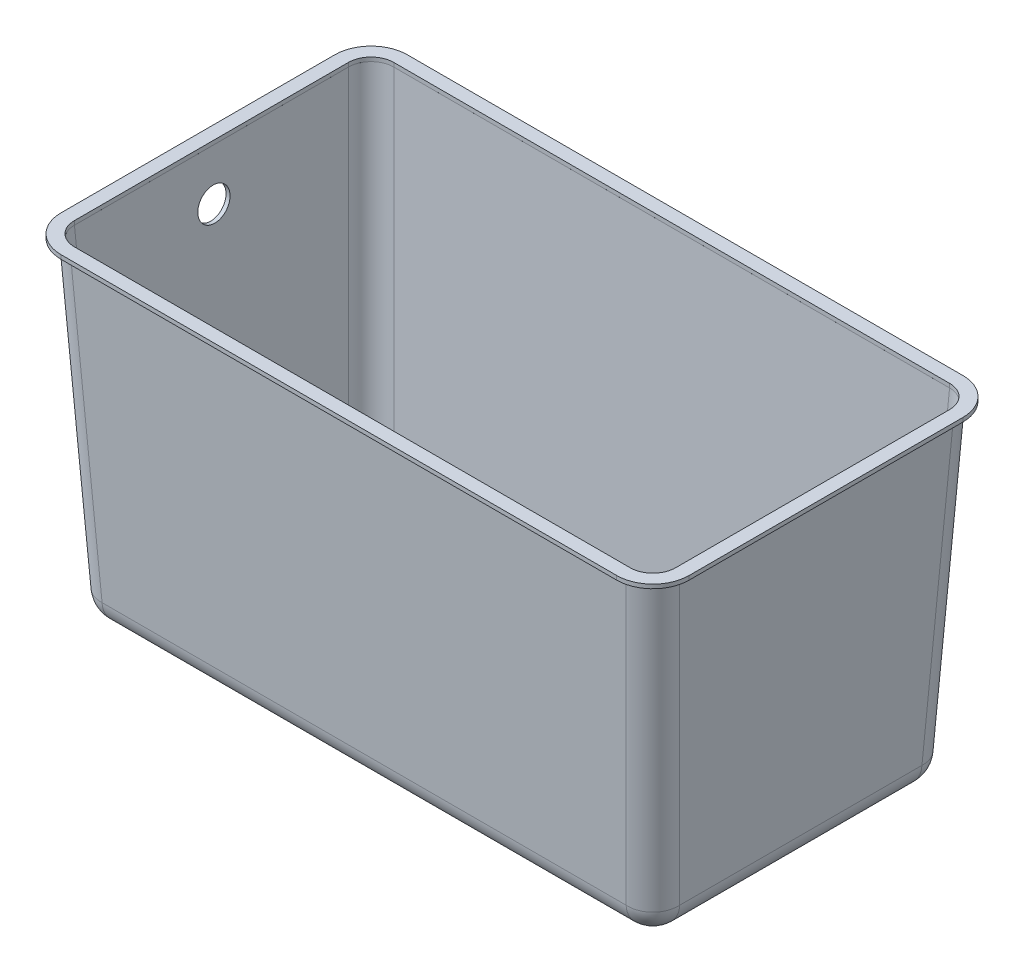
from build123d import *

# Parameters (mm, degrees)
ESQUISSE1_W             = 454
ESQUISSE1_H             = 244
EXTRUSION1_DEPTH        = 244
EXTRUSION1_DRAFT        = -3
CONG_1_R                = 20
COQUE1_T                = -3
EXTRUSION2_DEPTH        = 3
ESQUISSE3_R             = 12
ENL_V_MAT_EXTRU_1_DEPTH = 40


with BuildPart() as part:
    # Esquisse1 → Extrusion1 (with draft: the straight prism first)
    with BuildSketch(Plane(origin=(0, 0, 0), x_dir=(1, 0, 0), z_dir=(0, 1, 0))):
        with Locations((227, 122)):
            Rectangle(ESQUISSE1_W, ESQUISSE1_H)
    extrude(amount=-EXTRUSION1_DEPTH)
    # Extrusion1: the draft: its side faces are tilted about the plane it starts from
    extrusion1_sides = [part.faces().sort_by_distance(p)[0] for p in [
        (227, -122, 0),
        (454, -122, -122),
        (227, -122, -244),
        (0, -122, -122),
    ]]
    draft(extrusion1_sides, Plane(origin=(0, 0, 0), x_dir=(1, 0, 0), z_dir=(0, 1, 0)), EXTRUSION1_DRAFT)

    # Cong_1
    cong_1_edges = [part.edges().sort_by_distance(p)[0] for p in [
        (441.212501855, -244, -122),
        (227, -244, -231.212501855),
        (12.787498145, -244, -122),
        (227, -244, -12.787498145),
        (6.393749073, -122, -237.606250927),
        (447.606250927, -122, -237.606250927),
        (447.606250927, -122, -6.393749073),
        (6.393749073, -122, -6.393749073),
    ]]
    fillet(cong_1_edges, radius=CONG_1_R)

    # Coque1
    coque1_openings = [part.faces().sort_by_distance(p)[0] for p in [
        (227, 0, -122),
    ]]
    offset(amount=COQUE1_T, openings=coque1_openings, kind=Kind.INTERSECTION)

    # Esquisse2 → Extrusion2 (add)
    with BuildSketch(Plane(origin=(0, 0, 0), x_dir=(-1, 0, 0), z_dir=(0, 1, 0))):
        with BuildLine():
            Line((-461, -19.972590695), (-461, -224.027409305))
            add(Edge.make_bspline(
                [(-461, -224.027409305), (-461, -225.808461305), (-460.825667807, -227.55984756), (-460.313062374, -230.144196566), (-460.100033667, -230.998471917), (-459.587696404, -232.692340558), (-459.286918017, -233.534303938), (-458.273307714, -235.983597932), (-457.446117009, -237.532526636), (-456.224449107, -239.364675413), (-455.97064735, -239.725857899), (-455.44380435, -240.437560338), (-455.17002726, -240.788962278), (-454.324773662, -241.820041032), (-453.731751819, -242.474245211), (-451.866910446, -244.340440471), (-450.51012378, -245.456923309), (-448.668898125, -246.689265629), (-448.292246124, -246.928116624), (-447.530785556, -247.384943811), (-447.145842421, -247.603100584), (-445.978610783, -248.227375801), (-444.389287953, -248.979365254), (-442.734971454, -249.573117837), (-441.469545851, -249.958325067), (-441.043615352, -250.076691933), (-440.183366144, -250.293003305), (-439.748251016, -250.391069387), (-437.570177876, -250.825646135), (-435.808474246, -251), (-434.027409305, -251)],
                knots=[0, 0, 0, 0, 0.125, 0.125, 0.1875, 0.1875, 0.25, 0.25, 0.375, 0.375, 0.40625, 0.40625, 0.4375, 0.4375, 0.5, 0.5, 0.625, 0.625, 0.65625, 0.65625, 0.6875, 0.6875, 0.75, 0.8125, 0.8125, 0.84375, 0.84375, 0.875, 0.875, 1, 1, 1, 1], degree=3))
            Line((-434.027409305, -251), (-19.972590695, -251))
            add(Edge.make_bspline(
                [(-19.972590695, -251), (-18.191538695, -251), (-16.44015244, -250.825667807), (-13.855803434, -250.313062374), (-13.001528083, -250.100033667), (-11.307659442, -249.587696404), (-10.465696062, -249.286918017), (-8.016402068, -248.273307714), (-6.467473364, -247.446117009), (-4.635324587, -246.224449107), (-4.274142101, -245.97064735), (-3.562439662, -245.44380435), (-3.211037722, -245.17002726), (-2.179958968, -244.324773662), (-1.525754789, -243.731751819), (0.340440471, -241.866910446), (1.456923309, -240.51012378), (2.689265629, -238.668898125), (2.928116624, -238.292246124), (3.384943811, -237.530785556), (3.603100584, -237.145842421), (4.227375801, -235.978610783), (4.979365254, -234.389287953), (5.573117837, -232.734971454), (5.958325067, -231.469545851), (6.076691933, -231.043615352), (6.293003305, -230.183366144), (6.391069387, -229.748251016), (6.825646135, -227.570177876), (7, -225.808474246), (7, -224.027409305)],
                knots=[0, 0, 0, 0, 0.125, 0.125, 0.1875, 0.1875, 0.25, 0.25, 0.375, 0.375, 0.40625, 0.40625, 0.4375, 0.4375, 0.5, 0.5, 0.625, 0.625, 0.65625, 0.65625, 0.6875, 0.6875, 0.75, 0.8125, 0.8125, 0.84375, 0.84375, 0.875, 0.875, 1, 1, 1, 1], degree=3))
            Line((7, -224.027409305), (7, -19.972590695))
            add(Edge.make_bspline(
                [(7, -19.972590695), (7, -18.191538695), (6.825667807, -16.44015244), (6.313062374, -13.855803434), (6.100033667, -13.001528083), (5.587696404, -11.307659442), (5.286918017, -10.465696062), (4.273307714, -8.016402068), (3.446117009, -6.467473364), (2.224449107, -4.635324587), (1.97064735, -4.274142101), (1.44380435, -3.562439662), (1.17002726, -3.211037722), (0.324773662, -2.179958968), (-0.268248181, -1.525754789), (-2.133089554, 0.340440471), (-3.48987622, 1.456923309), (-5.331101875, 2.689265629), (-5.707753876, 2.928116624), (-6.469214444, 3.384943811), (-6.854157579, 3.603100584), (-8.021389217, 4.227375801), (-9.610712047, 4.979365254), (-11.265028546, 5.573117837), (-12.530454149, 5.958325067), (-12.956384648, 6.076691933), (-13.816633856, 6.293003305), (-14.251748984, 6.391069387), (-16.429822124, 6.825646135), (-18.191525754, 7), (-19.972590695, 7)],
                knots=[0, 0, 0, 0, 0.125, 0.125, 0.1875, 0.1875, 0.25, 0.25, 0.375, 0.375, 0.40625, 0.40625, 0.4375, 0.4375, 0.5, 0.5, 0.625, 0.625, 0.65625, 0.65625, 0.6875, 0.6875, 0.75, 0.8125, 0.8125, 0.84375, 0.84375, 0.875, 0.875, 1, 1, 1, 1], degree=3))
            Line((-19.972590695, 7), (-434.027409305, 7))
            add(Edge.make_bspline(
                [(-434.027409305, 7), (-435.808461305, 7), (-437.55984756, 6.825667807), (-440.144196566, 6.313062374), (-440.998471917, 6.100033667), (-442.692340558, 5.587696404), (-443.534303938, 5.286918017), (-445.983597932, 4.273307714), (-447.532526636, 3.446117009), (-449.364675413, 2.224449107), (-449.725857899, 1.97064735), (-450.437560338, 1.44380435), (-450.788962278, 1.17002726), (-451.820041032, 0.324773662), (-452.474245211, -0.268248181), (-454.340440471, -2.133089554), (-455.456923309, -3.48987622), (-456.689265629, -5.331101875), (-456.928116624, -5.707753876), (-457.384943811, -6.469214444), (-457.603100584, -6.854157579), (-458.227375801, -8.021389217), (-458.979365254, -9.610712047), (-459.573117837, -11.265028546), (-459.958325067, -12.530454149), (-460.076691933, -12.956384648), (-460.293003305, -13.816633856), (-460.391069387, -14.251748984), (-460.825646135, -16.429822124), (-461, -18.191525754), (-461, -19.972590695)],
                knots=[0, 0, 0, 0, 0.125, 0.125, 0.1875, 0.1875, 0.25, 0.25, 0.375, 0.375, 0.40625, 0.40625, 0.4375, 0.4375, 0.5, 0.5, 0.625, 0.625, 0.65625, 0.65625, 0.6875, 0.6875, 0.75, 0.8125, 0.8125, 0.84375, 0.84375, 0.875, 0.875, 1, 1, 1, 1], degree=3))
        make_face()
        with BuildLine():
            Line((-451, -19.972590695), (-451, -224.027409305))
            add(Edge.make_bspline(
                [(-451, -224.027409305), (-451, -226.236218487), (-450.330491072, -229.598183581), (-448.242924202, -233.50488335), (-445.40214866, -236.976545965), (-441.65132007, -239.478350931), (-437.382355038, -240.778378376), (-435.142326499, -241), (-434.027409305, -241)],
                knots=[0, 0, 0, 0, 0.25, 0.375, 0.5, 0.75, 0.875, 1, 1, 1, 1], degree=3))
            Line((-434.027409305, -241), (-19.972590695, -241))
            add(Edge.make_bspline(
                [(-19.972590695, -241), (-17.763781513, -241), (-14.401816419, -240.330491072), (-10.49511665, -238.242924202), (-7.023454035, -235.40214866), (-4.521649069, -231.65132007), (-3.221621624, -227.382355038), (-3, -225.142326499), (-3, -224.027409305)],
                knots=[0, 0, 0, 0, 0.25, 0.375, 0.5, 0.75, 0.875, 1, 1, 1, 1], degree=3))
            Line((-3, -224.027409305), (-3, -19.972590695))
            add(Edge.make_bspline(
                [(-3, -19.972590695), (-3, -17.763781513), (-3.669508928, -14.401816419), (-5.757075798, -10.49511665), (-8.59785134, -7.023454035), (-12.34867993, -4.521649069), (-16.617644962, -3.221621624), (-18.857673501, -3), (-19.972590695, -3)],
                knots=[0, 0, 0, 0, 0.25, 0.375, 0.5, 0.75, 0.875, 1, 1, 1, 1], degree=3))
            Line((-19.972590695, -3), (-434.027409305, -3))
            add(Edge.make_bspline(
                [(-434.027409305, -3), (-436.236218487, -3), (-439.598183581, -3.669508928), (-443.50488335, -5.757075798), (-446.976545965, -8.59785134), (-449.478350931, -12.34867993), (-450.778378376, -16.617644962), (-451, -18.857673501), (-451, -19.972590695)],
                knots=[0, 0, 0, 0, 0.25, 0.375, 0.5, 0.75, 0.875, 1, 1, 1, 1], degree=3))
        make_face(mode=Mode.SUBTRACT)
    extrude(amount=EXTRUSION2_DEPTH)

    # Esquisse3 → Enl_v. mat.-Extru.1 (cut)
    with BuildSketch(Plane(origin=(0, 0, 0), x_dir=(0, 0, -1), z_dir=(-0.998629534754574, -0.05233595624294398, 0))):
        with Locations(Location((122, 36.637759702, 0), (0, 0, 90))):
            Circle(ESQUISSE3_R)
    extrude(amount=-ENL_V_MAT_EXTRU_1_DEPTH, mode=Mode.SUBTRACT)


solid = part.part
